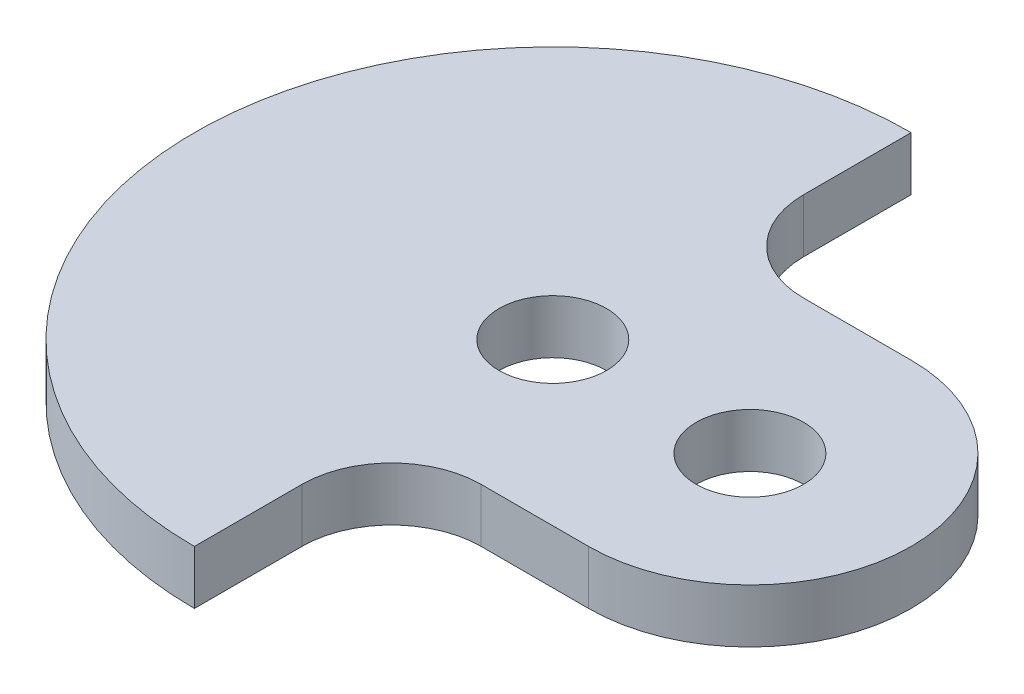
from build123d import *

# Parameters (mm, degrees)
SKETCH1_R      = 3
EXTRUDE1_DEPTH = 3


with BuildPart() as part:
    # Sketch1 → Extrude1 (new body)
    with BuildSketch(Plane(origin=(0, 0, 0), x_dir=(1, 0, 0), z_dir=(0, 1, 0))):
        with BuildLine():
            Line((39.666767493, 9), (45.666767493, 9))
            ThreePointArc((45.666767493, 9), (54.666767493, 0), (45.666767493, -9))
            Line((45.666767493, -9), (39.666767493, -9))
            ThreePointArc((39.666767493, -9), (36.131233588, -10.464466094), (34.666767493, -14))
            Line((34.666767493, -14), (34.666767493, -20))
            ThreePointArc((34.666767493, -20), (14.666767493, 0), (34.666767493, 20))
            Line((34.666767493, 20), (34.666767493, 14))
            ThreePointArc((34.666767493, 14), (36.131233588, 10.464466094), (39.666767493, 9))
        make_face()
        with Locations(Location((34.666767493, 0, 0), (0, 0, 270))):
            Circle(SKETCH1_R, mode=Mode.SUBTRACT)
        with Locations(Location((45.666767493, 0, 0), (0, 0, 270))):
            Circle(SKETCH1_R, mode=Mode.SUBTRACT)
    extrude(amount=EXTRUDE1_DEPTH)


solid = part.part
